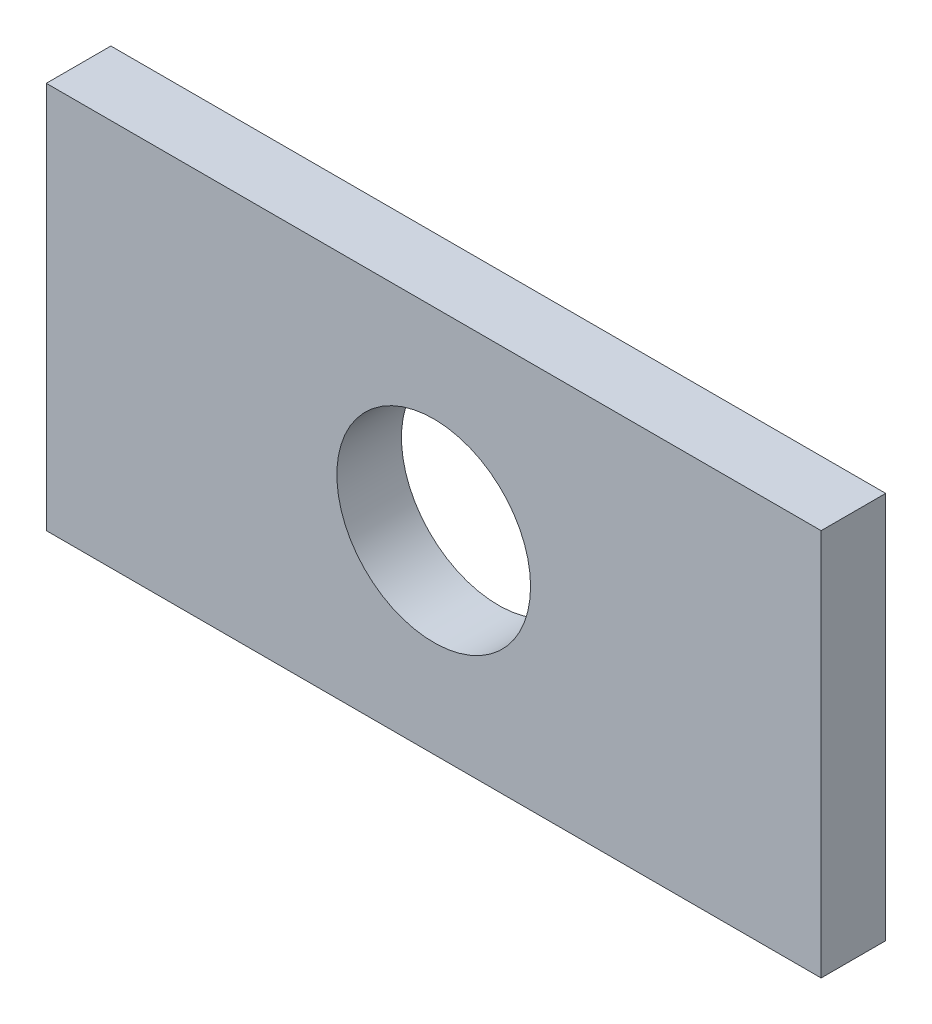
from build123d import *

# Parameters (mm, degrees)
SKETCH1_W          = 152.4
SKETCH1_H          = 76.2
EXTRUDE1_DEPTH     = 6.35
SKETCH2_R          = 19.05
CUT_EXTRUDE1_DEPTH = 87.135590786


with BuildPart() as part:
    # Sketch1 → Extrude1 (new, symmetric)
    with BuildSketch(Plane.XY):
        Rectangle(SKETCH1_W, SKETCH1_H)
    extrude(amount=EXTRUDE1_DEPTH, both=True)

    # Sketch2 → Cut-Extrude1 (cut, through all)
    with BuildSketch(Plane.XY.offset(6.35)):
        Circle(SKETCH2_R)
    extrude(amount=-CUT_EXTRUDE1_DEPTH, mode=Mode.SUBTRACT)


solid = part.part
